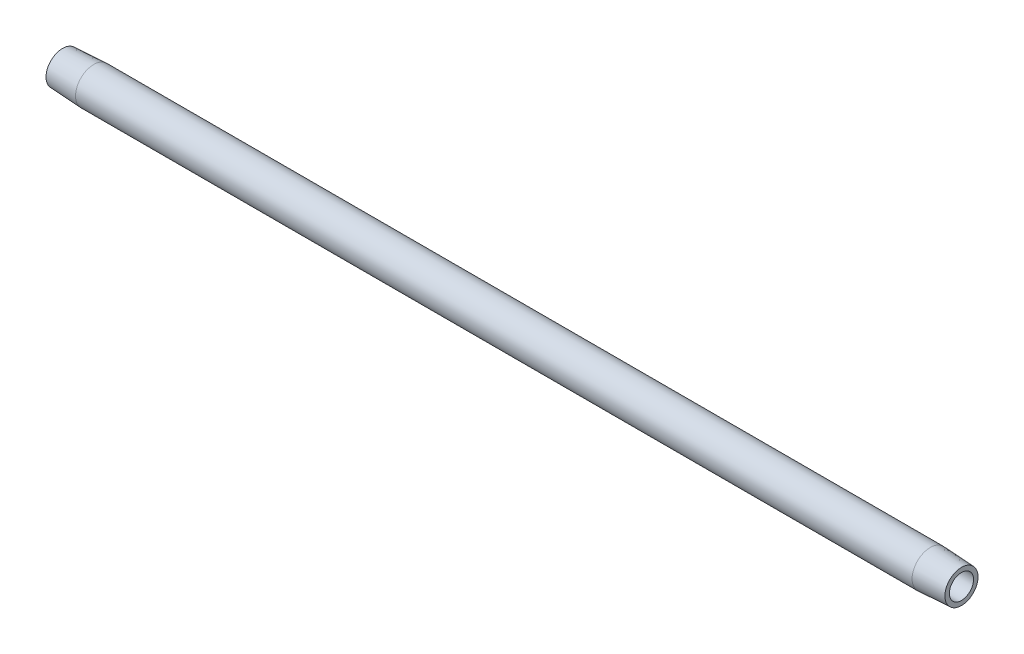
ISO-10303-21;
HEADER;
FILE_DESCRIPTION(('STEP AP214'),'2;1');
FILE_NAME('part.step','',(''),(''),'','','');
FILE_SCHEMA(('AUTOMOTIVE_DESIGN { 1 0 10303 214 1 1 1 1 }'));
ENDSEC;
DATA;
#1=APPLICATION_CONTEXT('core data for automotive mechanical design processes');
#2=APPLICATION_PROTOCOL_DEFINITION('international standard','automotive_design',2000,#1);
#3=PRODUCT_CONTEXT('',#1,'mechanical');
#4=PRODUCT('Part','Part','',(#3));
#5=PRODUCT_RELATED_PRODUCT_CATEGORY('part','',(#4));
#6=PRODUCT_DEFINITION_FORMATION('','',#4);
#7=PRODUCT_DEFINITION_CONTEXT('part definition',#1,'design');
#8=PRODUCT_DEFINITION('design','',#6,#7);
#9=PRODUCT_DEFINITION_SHAPE('','',#8);
#10=(LENGTH_UNIT() NAMED_UNIT(*) SI_UNIT(.MILLI.,.METRE.));
#11=(NAMED_UNIT(*) PLANE_ANGLE_UNIT() SI_UNIT($,.RADIAN.));
#12=(NAMED_UNIT(*) SI_UNIT($,.STERADIAN.) SOLID_ANGLE_UNIT());
#13=UNCERTAINTY_MEASURE_WITH_UNIT(LENGTH_MEASURE(1.E-05),#10,'distance_accuracy_value','');
#14=(GEOMETRIC_REPRESENTATION_CONTEXT(3) GLOBAL_UNCERTAINTY_ASSIGNED_CONTEXT((#13)) GLOBAL_UNIT_ASSIGNED_CONTEXT((#10,
#11,#12)) REPRESENTATION_CONTEXT('',''));
#15=CARTESIAN_POINT('',(0.,0.,0.));
#16=DIRECTION('',(0.,0.,1.));
#17=DIRECTION('',(1.,0.,0.));
#18=AXIS2_PLACEMENT_3D('',#15,#16,#17);
#19=CARTESIAN_POINT('',(0.476141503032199,0.,0.));
#20=DIRECTION('',(-1.,0.,0.));
#21=DIRECTION('',(0.,0.,1.));
#22=AXIS2_PLACEMENT_3D('',#19,#20,#21);
#23=CYLINDRICAL_SURFACE('',#22,5.14349999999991);
#24=CARTESIAN_POINT('',(8.8100393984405,0.,0.));
#25=DIRECTION('',(-1.,0.,0.));
#26=DIRECTION('',(0.,0.,1.));
#27=AXIS2_PLACEMENT_3D('',#24,#25,#26);
#28=CIRCLE('',#27,5.14349999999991);
#29=CARTESIAN_POINT('',(8.8100393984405,0.,5.14349999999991));
#30=VERTEX_POINT('',#29);
#31=EDGE_CURVE('E10',#30,#30,#28,.T.);
#32=ORIENTED_EDGE('',*,*,#31,.F.);
#33=EDGE_LOOP('',(#32));
#34=FACE_BOUND('',#33,.T.);
#35=CARTESIAN_POINT('',(245.189960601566,0.,0.));
#36=DIRECTION('',(-1.,0.,0.));
#37=DIRECTION('',(0.,0.,1.));
#38=AXIS2_PLACEMENT_3D('',#35,#36,#37);
#39=CIRCLE('',#38,5.14349999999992);
#40=CARTESIAN_POINT('',(245.189960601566,0.,5.14349999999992));
#41=VERTEX_POINT('',#40);
#42=EDGE_CURVE('E52',#41,#41,#39,.T.);
#43=ORIENTED_EDGE('',*,*,#42,.T.);
#44=EDGE_LOOP('',(#43));
#45=FACE_BOUND('',#44,.T.);
#46=ADVANCED_FACE('F30',(#34,#45),#23,.T.);
#47=CARTESIAN_POINT('',(8.8100393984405,0.,0.));
#48=DIRECTION('',(1.,0.,0.));
#49=DIRECTION('',(0.,0.,-1.));
#50=AXIS2_PLACEMENT_3D('',#47,#48,#49);
#51=CONICAL_SURFACE('',#50,5.14349999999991,0.0523598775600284);
#52=CARTESIAN_POINT('',(0.,0.,0.));
#53=DIRECTION('',(-1.,0.,0.));
#54=DIRECTION('',(0.,0.,1.));
#55=AXIS2_PLACEMENT_3D('',#52,#53,#54);
#56=CIRCLE('',#55,4.68178539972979);
#57=CARTESIAN_POINT('',(0.,0.,4.68178539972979));
#58=VERTEX_POINT('',#57);
#59=EDGE_CURVE('E36',#58,#58,#56,.T.);
#60=ORIENTED_EDGE('',*,*,#59,.F.);
#61=EDGE_LOOP('',(#60));
#62=FACE_BOUND('',#61,.T.);
#63=ORIENTED_EDGE('',*,*,#31,.T.);
#64=EDGE_LOOP('',(#63));
#65=FACE_BOUND('',#64,.T.);
#66=ADVANCED_FACE('F77',(#62,#65),#51,.T.);
#67=CARTESIAN_POINT('',(0.,4.68178539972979,0.));
#68=DIRECTION('',(1.,0.,0.));
#69=DIRECTION('',(0.,0.,-1.));
#70=AXIS2_PLACEMENT_3D('',#67,#68,#69);
#71=PLANE('',#70);
#72=CARTESIAN_POINT('',(0.,0.,0.));
#73=DIRECTION('',(-1.,0.,0.));
#74=DIRECTION('',(0.,0.,1.));
#75=AXIS2_PLACEMENT_3D('',#72,#73,#74);
#76=CIRCLE('',#75,3.4163);
#77=CARTESIAN_POINT('',(0.,0.,3.4163));
#78=VERTEX_POINT('',#77);
#79=EDGE_CURVE('E40',#78,#78,#76,.T.);
#80=ORIENTED_EDGE('',*,*,#79,.F.);
#81=EDGE_LOOP('',(#80));
#82=FACE_BOUND('',#81,.T.);
#83=ORIENTED_EDGE('',*,*,#59,.T.);
#84=EDGE_LOOP('',(#83));
#85=FACE_BOUND('',#84,.T.);
#86=ADVANCED_FACE('F72',(#82,#85),#71,.F.);
#87=CARTESIAN_POINT('',(0.476141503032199,0.,0.));
#88=DIRECTION('',(-1.,0.,0.));
#89=DIRECTION('',(0.,0.,1.));
#90=AXIS2_PLACEMENT_3D('',#87,#88,#89);
#91=CYLINDRICAL_SURFACE('',#90,3.4163);
#92=CARTESIAN_POINT('',(254.,0.,0.));
#93=DIRECTION('',(-1.,0.,0.));
#94=DIRECTION('',(0.,0.,1.));
#95=AXIS2_PLACEMENT_3D('',#92,#93,#94);
#96=CIRCLE('',#95,3.41630000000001);
#97=CARTESIAN_POINT('',(254.,0.,3.41630000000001));
#98=VERTEX_POINT('',#97);
#99=EDGE_CURVE('E44',#98,#98,#96,.T.);
#100=ORIENTED_EDGE('',*,*,#99,.F.);
#101=EDGE_LOOP('',(#100));
#102=FACE_BOUND('',#101,.T.);
#103=ORIENTED_EDGE('',*,*,#79,.T.);
#104=EDGE_LOOP('',(#103));
#105=FACE_BOUND('',#104,.T.);
#106=ADVANCED_FACE('F66',(#102,#105),#91,.F.);
#107=CARTESIAN_POINT('',(254.,3.41630000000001,0.));
#108=DIRECTION('',(-1.,0.,0.));
#109=DIRECTION('',(0.,0.,1.));
#110=AXIS2_PLACEMENT_3D('',#107,#108,#109);
#111=PLANE('',#110);
#112=CARTESIAN_POINT('',(254.,0.,0.));
#113=DIRECTION('',(-1.,0.,0.));
#114=DIRECTION('',(0.,0.,1.));
#115=AXIS2_PLACEMENT_3D('',#112,#113,#114);
#116=CIRCLE('',#115,4.68178539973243);
#117=CARTESIAN_POINT('',(254.,0.,4.68178539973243));
#118=VERTEX_POINT('',#117);
#119=EDGE_CURVE('E49',#118,#118,#116,.T.);
#120=ORIENTED_EDGE('',*,*,#119,.F.);
#121=EDGE_LOOP('',(#120));
#122=FACE_BOUND('',#121,.T.);
#123=ORIENTED_EDGE('',*,*,#99,.T.);
#124=EDGE_LOOP('',(#123));
#125=FACE_BOUND('',#124,.T.);
#126=ADVANCED_FACE('F60',(#122,#125),#111,.F.);
#127=CARTESIAN_POINT('',(254.,0.,0.));
#128=DIRECTION('',(-1.,0.,0.));
#129=DIRECTION('',(0.,0.,1.));
#130=AXIS2_PLACEMENT_3D('',#127,#128,#129);
#131=CONICAL_SURFACE('',#130,4.68178539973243,0.0523598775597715);
#132=ORIENTED_EDGE('',*,*,#42,.F.);
#133=EDGE_LOOP('',(#132));
#134=FACE_BOUND('',#133,.T.);
#135=ORIENTED_EDGE('',*,*,#119,.T.);
#136=EDGE_LOOP('',(#135));
#137=FACE_BOUND('',#136,.T.);
#138=ADVANCED_FACE('F57',(#134,#137),#131,.T.);
#139=CLOSED_SHELL('',(#46,#66,#86,#106,#126,#138));
#140=MANIFOLD_SOLID_BREP('B2',#139);
#141=ADVANCED_BREP_SHAPE_REPRESENTATION('',(#18,#140),#14);
#142=SHAPE_DEFINITION_REPRESENTATION(#9,#141);
ENDSEC;
END-ISO-10303-21;
